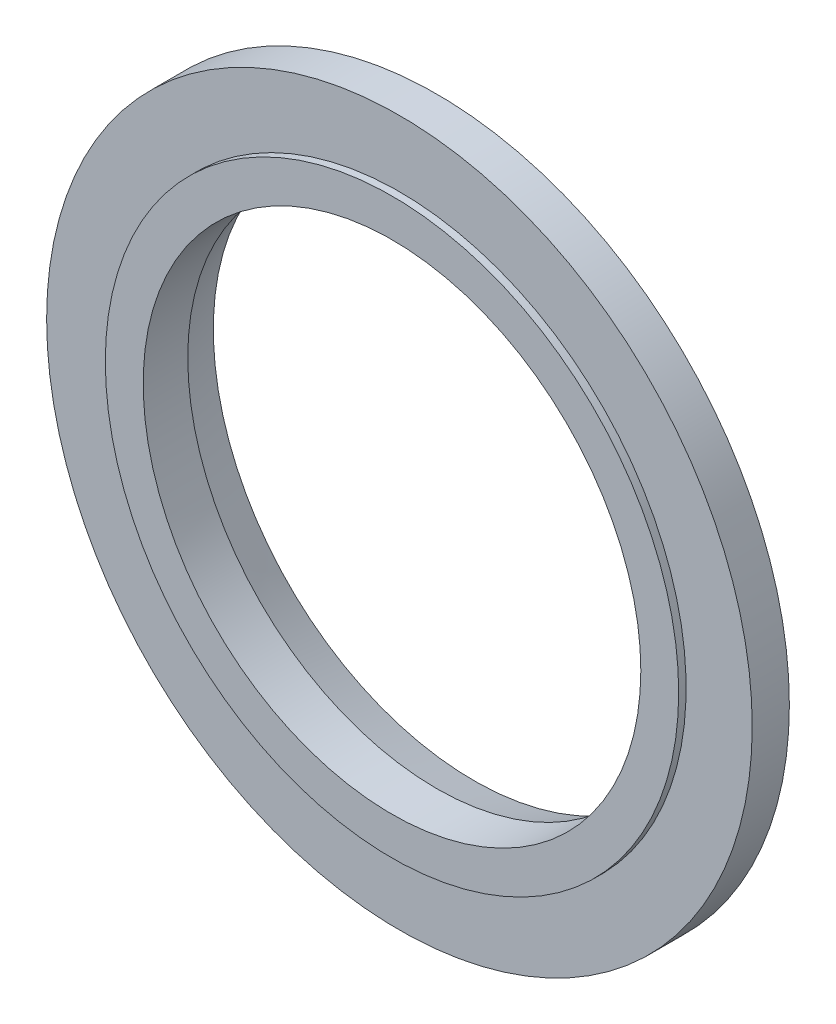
from build123d import *

# Parameters (mm, degrees)
SKETCH1_R           = 24.511
SKETCH1_R_2         = 20.6375
BOSS_EXTRUDE1_DEPTH = 3.175
SKETCH3_R           = 25.7175
SKETCH3_R_2         = 19.05
BOSS_EXTRUDE2_DEPTH = 2.54
BOSS_EXTRUDE3_START = 0.635
SKETCH4_2_R         = 25.7175
SKETCH4_2_R_2       = 19.05
BOSS_EXTRUDE3_DEPTH = 0.635
SKETCH6_R           = 21.2725
CUT_EXTRUDE3_DEPTH  = 38.039510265
SKETCH7_R           = 26.67
SKETCH7_R_2         = 25.7175
BOSS_EXTRUDE4_DEPTH = 3.175
BOSS_EXTRUDE5_START = -3.175
SKETCH8_R           = 30.1625
SKETCH8_R_2         = 26.67
BOSS_EXTRUDE5_DEPTH = 3.175


with BuildPart() as part:
    # Sketch1 → Boss-Extrude1 (new body)
    with BuildSketch(Plane.XY):
        Circle(SKETCH1_R)
        Circle(SKETCH1_R_2, mode=Mode.SUBTRACT)
    extrude(amount=BOSS_EXTRUDE1_DEPTH)

    # Sketch2 → Revolve1 (revolve)
    with BuildSketch(Plane(origin=(0, 0, 0), x_dir=(1, 0, 0), z_dir=(0, 1, 0)), mode=Mode.PRIVATE) as revolve1_sk:
        Polygon((-23.5585, 3.8354), (-24.511, 0.6604), (-24.511, 0), (-21.336, 0), (-21.336, 0.6604), (-22.2885, 3.8354), (-22.2885, 0.0254), (-23.5585, 0.0254), align=None)
    revolve(revolve1_sk.sketch.rotate(Axis((0, 0, 3.175), (0, 0, -1)), 180), axis=Axis((0, 0, 3.175), (0, 0, -1)))

    # Sketch3 → Boss-Extrude2 (add)
    with BuildSketch(Plane(origin=(0, 0, 0), x_dir=(-1, 0, 0), z_dir=(0, 0, -1))):
        Circle(SKETCH3_R)
        Circle(SKETCH3_R_2, mode=Mode.SUBTRACT)
    extrude(amount=-BOSS_EXTRUDE2_DEPTH)

    # Sketch4_2 → Boss-Extrude3 (add)
    with BuildSketch(Plane(origin=(0, 0, 0), x_dir=(-1, 0, 0), z_dir=(0, 0, -1)).offset(BOSS_EXTRUDE3_START)):
        Circle(SKETCH4_2_R)
        Circle(SKETCH4_2_R_2, mode=Mode.SUBTRACT)
    extrude(amount=-BOSS_EXTRUDE3_DEPTH)

    # Sketch6 → Cut-Extrude3 (cut, through all)
    with BuildSketch(Plane.XY.offset(3.175)):
        Circle(SKETCH6_R)
    extrude(amount=-CUT_EXTRUDE3_DEPTH, mode=Mode.SUBTRACT)

    # Sketch7 → Boss-Extrude4 (add)
    with BuildSketch(Plane(origin=(0, 0, -0.635), x_dir=(-1, 0, 0), z_dir=(0, 0, -1))):
        Circle(SKETCH7_R)
        Circle(SKETCH7_R_2, mode=Mode.SUBTRACT)
    extrude(amount=-BOSS_EXTRUDE4_DEPTH)

    # Sketch8 → Boss-Extrude5 (add)
    with BuildSketch(Plane.XY.offset(2.54).offset(BOSS_EXTRUDE5_START)):
        Circle(SKETCH8_R)
        Circle(SKETCH8_R_2, mode=Mode.SUBTRACT)
    extrude(amount=BOSS_EXTRUDE5_DEPTH)


solid = part.part
